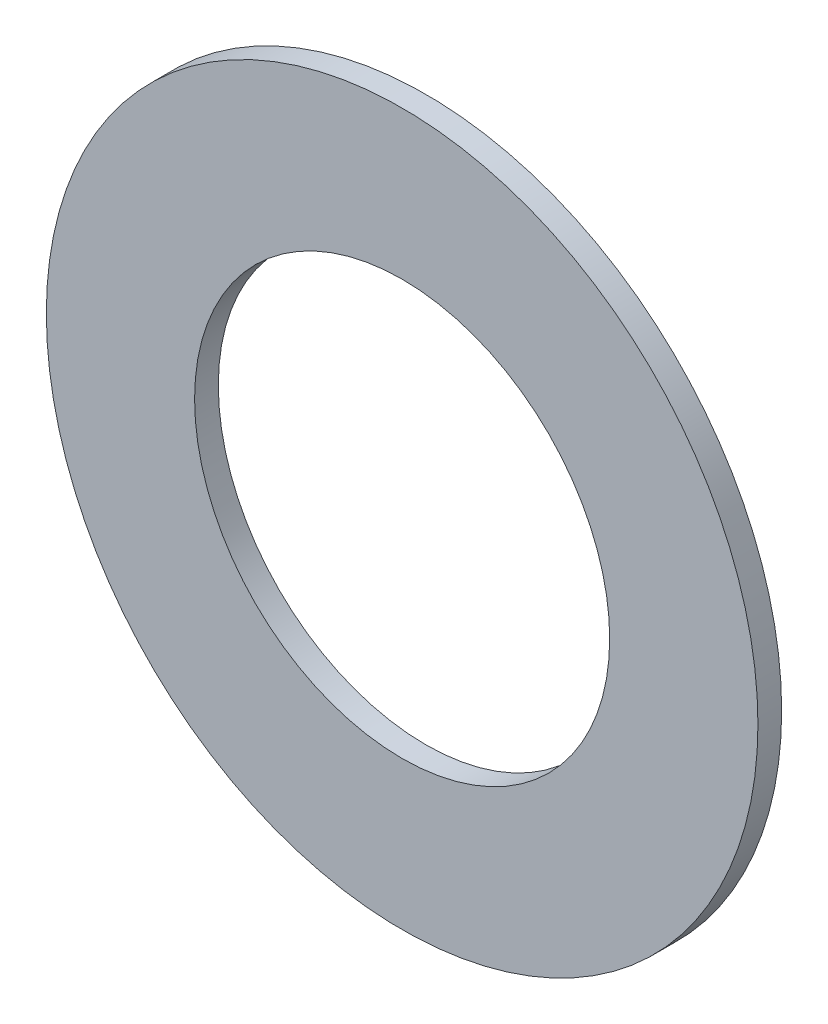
ISO-10303-21;
HEADER;
FILE_DESCRIPTION(('STEP AP214'),'2;1');
FILE_NAME('part.step','',(''),(''),'','','');
FILE_SCHEMA(('AUTOMOTIVE_DESIGN { 1 0 10303 214 1 1 1 1 }'));
ENDSEC;
DATA;
#1=APPLICATION_CONTEXT('core data for automotive mechanical design processes');
#2=APPLICATION_PROTOCOL_DEFINITION('international standard','automotive_design',2000,#1);
#3=PRODUCT_CONTEXT('',#1,'mechanical');
#4=PRODUCT('Part','Part','',(#3));
#5=PRODUCT_RELATED_PRODUCT_CATEGORY('part','',(#4));
#6=PRODUCT_DEFINITION_FORMATION('','',#4);
#7=PRODUCT_DEFINITION_CONTEXT('part definition',#1,'design');
#8=PRODUCT_DEFINITION('design','',#6,#7);
#9=PRODUCT_DEFINITION_SHAPE('','',#8);
#10=(LENGTH_UNIT() NAMED_UNIT(*) SI_UNIT(.MILLI.,.METRE.));
#11=(NAMED_UNIT(*) PLANE_ANGLE_UNIT() SI_UNIT($,.RADIAN.));
#12=(NAMED_UNIT(*) SI_UNIT($,.STERADIAN.) SOLID_ANGLE_UNIT());
#13=UNCERTAINTY_MEASURE_WITH_UNIT(LENGTH_MEASURE(1.E-05),#10,'distance_accuracy_value','');
#14=(GEOMETRIC_REPRESENTATION_CONTEXT(3) GLOBAL_UNCERTAINTY_ASSIGNED_CONTEXT((#13)) GLOBAL_UNIT_ASSIGNED_CONTEXT((#10,
#11,#12)) REPRESENTATION_CONTEXT('',''));
#15=CARTESIAN_POINT('',(0.,0.,0.));
#16=DIRECTION('',(0.,0.,1.));
#17=DIRECTION('',(1.,0.,0.));
#18=AXIS2_PLACEMENT_3D('',#15,#16,#17);
#19=CARTESIAN_POINT('',(0.,0.,0.4));
#20=DIRECTION('',(0.,0.,-1.));
#21=DIRECTION('',(-1.,0.,0.));
#22=AXIS2_PLACEMENT_3D('',#19,#20,#21);
#23=CYLINDRICAL_SURFACE('',#22,6.);
#24=CARTESIAN_POINT('',(0.,0.,0.4));
#25=DIRECTION('',(0.,0.,1.));
#26=DIRECTION('',(1.,0.,0.));
#27=AXIS2_PLACEMENT_3D('',#24,#25,#26);
#28=CIRCLE('',#27,6.);
#29=CARTESIAN_POINT('',(6.,0.,0.4));
#30=VERTEX_POINT('',#29);
#31=EDGE_CURVE('E10',#30,#30,#28,.T.);
#32=ORIENTED_EDGE('',*,*,#31,.F.);
#33=EDGE_LOOP('',(#32));
#34=FACE_BOUND('',#33,.T.);
#35=CARTESIAN_POINT('',(0.,0.,0.));
#36=DIRECTION('',(0.,0.,1.));
#37=DIRECTION('',(1.,0.,0.));
#38=AXIS2_PLACEMENT_3D('',#35,#36,#37);
#39=CIRCLE('',#38,6.);
#40=CARTESIAN_POINT('',(6.,0.,0.));
#41=VERTEX_POINT('',#40);
#42=EDGE_CURVE('E32',#41,#41,#39,.T.);
#43=ORIENTED_EDGE('',*,*,#42,.T.);
#44=EDGE_LOOP('',(#43));
#45=FACE_BOUND('',#44,.T.);
#46=ADVANCED_FACE('F29',(#34,#45),#23,.T.);
#47=CARTESIAN_POINT('',(0.,0.,0.4));
#48=DIRECTION('',(0.,0.,1.));
#49=DIRECTION('',(1.,0.,0.));
#50=AXIS2_PLACEMENT_3D('',#47,#48,#49);
#51=PLANE('',#50);
#52=CARTESIAN_POINT('',(0.,0.,0.4));
#53=DIRECTION('',(0.,0.,1.));
#54=DIRECTION('',(1.,0.,0.));
#55=AXIS2_PLACEMENT_3D('',#52,#53,#54);
#56=CIRCLE('',#55,3.5);
#57=CARTESIAN_POINT('',(3.5,0.,0.4));
#58=VERTEX_POINT('',#57);
#59=EDGE_CURVE('E43',#58,#58,#56,.T.);
#60=ORIENTED_EDGE('',*,*,#59,.F.);
#61=EDGE_LOOP('',(#60));
#62=FACE_BOUND('',#61,.T.);
#63=ORIENTED_EDGE('',*,*,#31,.T.);
#64=EDGE_LOOP('',(#63));
#65=FACE_BOUND('',#64,.T.);
#66=ADVANCED_FACE('F49',(#62,#65),#51,.T.);
#67=CARTESIAN_POINT('',(0.,0.,0.));
#68=DIRECTION('',(0.,0.,1.));
#69=DIRECTION('',(1.,0.,0.));
#70=AXIS2_PLACEMENT_3D('',#67,#68,#69);
#71=PLANE('',#70);
#72=CARTESIAN_POINT('',(0.,0.,0.));
#73=DIRECTION('',(0.,0.,1.));
#74=DIRECTION('',(1.,0.,0.));
#75=AXIS2_PLACEMENT_3D('',#72,#73,#74);
#76=CIRCLE('',#75,3.5);
#77=CARTESIAN_POINT('',(3.5,0.,0.));
#78=VERTEX_POINT('',#77);
#79=EDGE_CURVE('E39',#78,#78,#76,.F.);
#80=ORIENTED_EDGE('',*,*,#79,.F.);
#81=EDGE_LOOP('',(#80));
#82=FACE_BOUND('',#81,.T.);
#83=ORIENTED_EDGE('',*,*,#42,.F.);
#84=EDGE_LOOP('',(#83));
#85=FACE_BOUND('',#84,.T.);
#86=ADVANCED_FACE('F51',(#82,#85),#71,.F.);
#87=CARTESIAN_POINT('',(0.,0.,-9.89949493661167));
#88=DIRECTION('',(0.,0.,1.));
#89=DIRECTION('',(1.,0.,0.));
#90=AXIS2_PLACEMENT_3D('',#87,#88,#89);
#91=CYLINDRICAL_SURFACE('',#90,3.5);
#92=ORIENTED_EDGE('',*,*,#79,.T.);
#93=EDGE_LOOP('',(#92));
#94=FACE_BOUND('',#93,.T.);
#95=ORIENTED_EDGE('',*,*,#59,.T.);
#96=EDGE_LOOP('',(#95));
#97=FACE_BOUND('',#96,.T.);
#98=ADVANCED_FACE('F47',(#94,#97),#91,.F.);
#99=CLOSED_SHELL('',(#46,#66,#86,#98));
#100=MANIFOLD_SOLID_BREP('B2',#99);
#101=ADVANCED_BREP_SHAPE_REPRESENTATION('',(#18,#100),#14);
#102=SHAPE_DEFINITION_REPRESENTATION(#9,#101);
ENDSEC;
END-ISO-10303-21;
